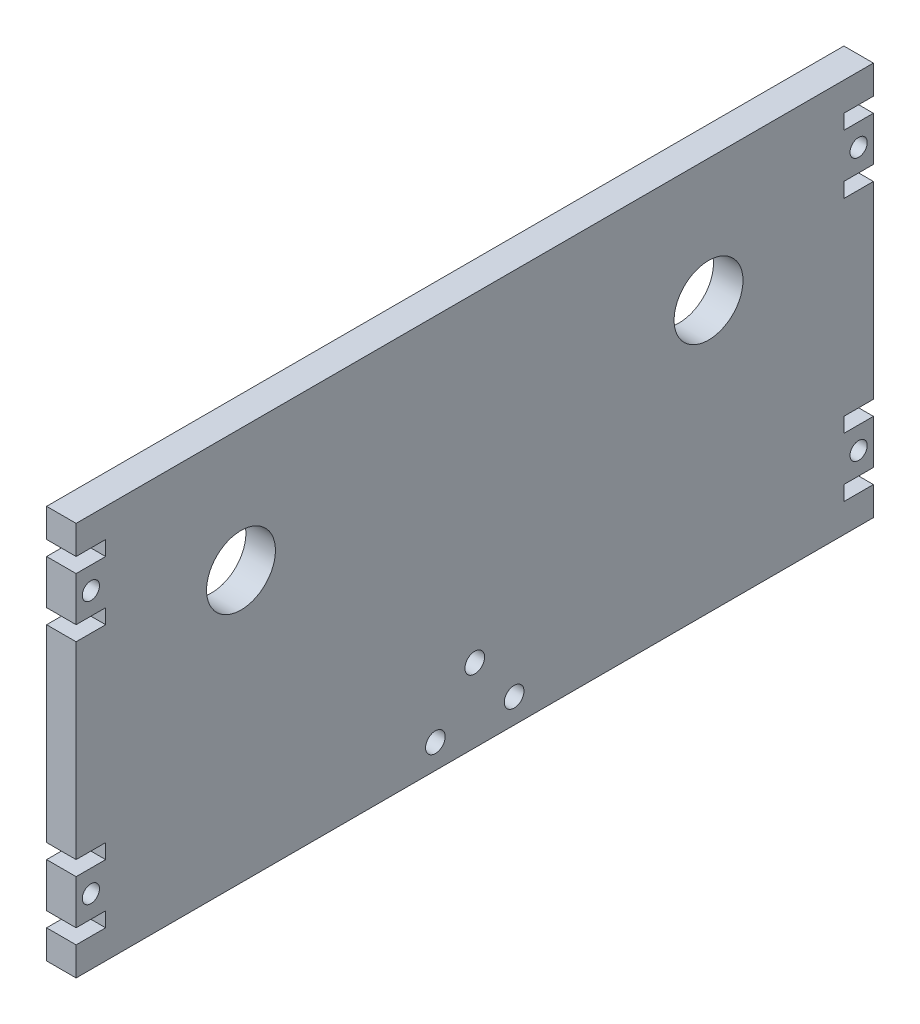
from build123d import *

# Parameters (mm, degrees)
SKETCH1_W           = 162
SKETCH1_H           = 80
BOSS_EXTRUDE1_DEPTH = 3
SKETCH2_R           = 7
CUT_EXTRUDE1_DEPTH  = 91.537285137
SKETCH3_R           = 2
CUT_EXTRUDE2_DEPTH  = 91.537285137
SKETCH4_R           = 1.75
SKETCH4_W           = 6
SKETCH4_H           = 3
CUT_EXTRUDE3_DEPTH  = 91.537285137


with BuildPart() as part:
    # Sketch1 → Boss-Extrude1 (new, symmetric)
    with BuildSketch(Plane(origin=(0, 0, 0), x_dir=(0, 0, -1), z_dir=(1, 0, 0))):
        Rectangle(SKETCH1_W, SKETCH1_H)
    extrude(amount=BOSS_EXTRUDE1_DEPTH, both=True)

    # Sketch2 → Cut-Extrude1 (cut, through all)
    with BuildSketch(Plane(origin=(3, 0, 0), x_dir=(0, 0, -1), z_dir=(1, 0, 0))):
        with Locations((-47.5, 15)):
            Circle(SKETCH2_R)
        with Locations((47.5, 15)):
            Circle(SKETCH2_R)
    extrude(amount=-CUT_EXTRUDE1_DEPTH, mode=Mode.SUBTRACT)

    # Sketch3 → Cut-Extrude2 (cut, through all)
    with BuildSketch(Plane(origin=(3, 0, 0), x_dir=(0, 0, -1), z_dir=(1, 0, 0))):
        with Locations((-8, -35)):
            Circle(SKETCH3_R)
        with Locations((8, -35)):
            Circle(SKETCH3_R)
        with Locations((0, -25)):
            Circle(SKETCH3_R)
    extrude(amount=-CUT_EXTRUDE2_DEPTH, mode=Mode.SUBTRACT)

    # Sketch4 → Cut-Extrude3 (cut, through all)
    with BuildSketch(Plane(origin=(3, 0, 0), x_dir=(0, 0, -1), z_dir=(1, 0, 0))):
        with Locations((-78, 26.666666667)):
            Circle(SKETCH4_R)
        with Locations((-78, -26.666666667)):
            Circle(SKETCH4_R)
        with Locations(Location((78, -26.666666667, 0), (0, 0, 180))):
            Circle(SKETCH4_R)
        with Locations(Location((78, 26.666666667, 0), (0, 0, 180))):
            Circle(SKETCH4_R)
        with Locations((-78, 32.666666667)):
            Rectangle(SKETCH4_W, SKETCH4_H)
        with Locations((-78, 20.666666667)):
            Rectangle(SKETCH4_W, SKETCH4_H)
        with Locations((-78, -20.666666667)):
            Rectangle(SKETCH4_W, SKETCH4_H)
        with Locations((-78, -32.666666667)):
            Rectangle(SKETCH4_W, SKETCH4_H)
        with Locations((78, -32.666666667)):
            Rectangle(SKETCH4_W, SKETCH4_H)
        with Locations((78, -20.666666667)):
            Rectangle(SKETCH4_W, SKETCH4_H)
        with Locations((78, 20.666666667)):
            Rectangle(SKETCH4_W, SKETCH4_H)
        with Locations((78, 32.666666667)):
            Rectangle(SKETCH4_W, SKETCH4_H)
    extrude(amount=-CUT_EXTRUDE3_DEPTH, mode=Mode.SUBTRACT)


solid = part.part
